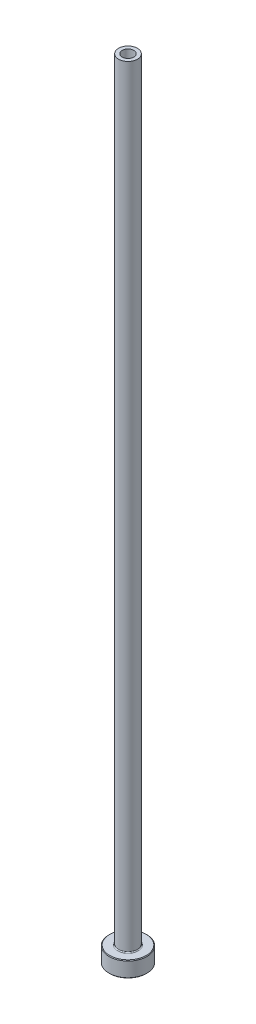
from build123d import *

# Parameters (mm, degrees)
FILLET1_R     = 0.3
CHAMFER1_SIZE = 0.2
CHAMFER3_SIZE = 0.5


with BuildPart() as part:
    # Sketch1 → Revolve1 (revolve)
    with BuildSketch(Plane.XY, mode=Mode.PRIVATE) as revolve1_sk:
        Polygon((-1.85, 250), (-3, 250), (-3, 5), (-6, 5), (-6, 0), (-2.1, 0), (-2.1, 193), (-1.85, 205), align=None)
    revolve(revolve1_sk.sketch.rotate(Axis((0, 92.187680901, 0), (0, -1, 0)), 270), axis=Axis((0, 92.187680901, 0), (0, -1, 0)))

    # Fillet1
    fillet1_edges = [part.edges().sort_by_distance(p)[0] for p in [
        (0, 5, -3),
    ]]
    fillet(fillet1_edges, radius=FILLET1_R)

    # Chamfer1
    chamfer1_edges = [part.edges().sort_by_distance(p)[0] for p in [
        (0, 0, -6),
        (0, 5, -6),
    ]]
    chamfer(chamfer1_edges, length=CHAMFER1_SIZE)

    # Chamfer3
    chamfer3_edges = [part.edges().sort_by_distance(p)[0] for p in [
        (0, 0, -2.1),
    ]]
    chamfer(chamfer3_edges, length=CHAMFER3_SIZE)


solid = part.part
